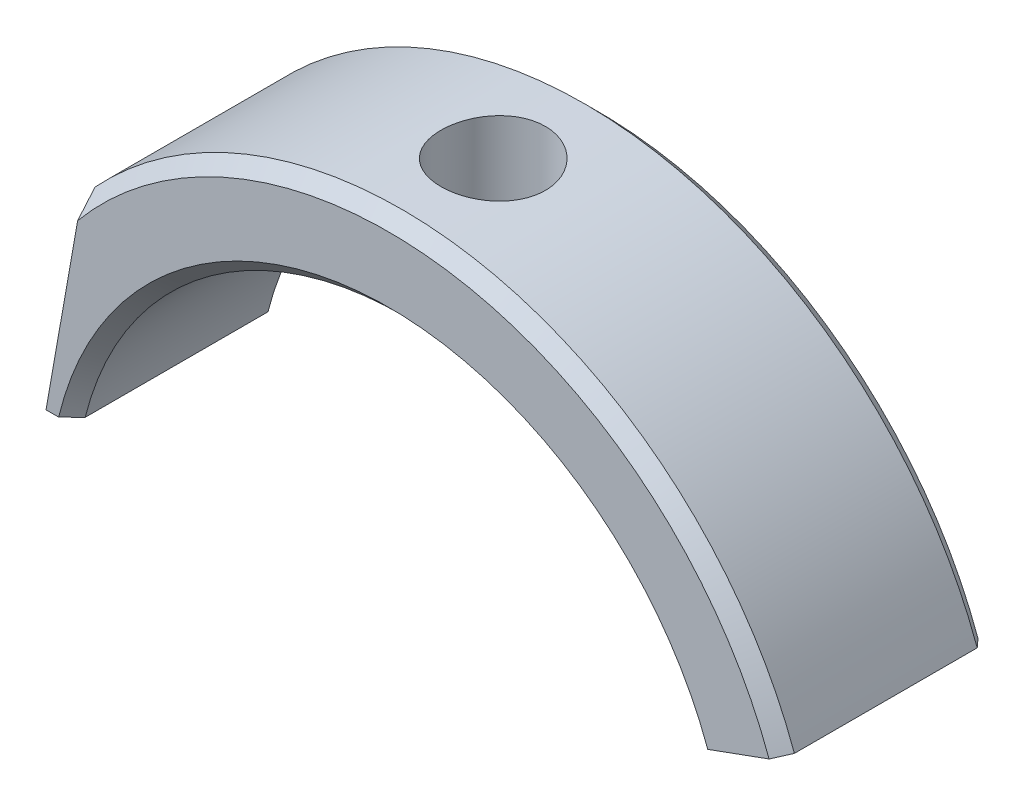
ISO-10303-21;
HEADER;
FILE_DESCRIPTION(('STEP AP214'),'2;1');
FILE_NAME('part.step','',(''),(''),'','','');
FILE_SCHEMA(('AUTOMOTIVE_DESIGN { 1 0 10303 214 1 1 1 1 }'));
ENDSEC;
DATA;
#1=APPLICATION_CONTEXT('core data for automotive mechanical design processes');
#2=APPLICATION_PROTOCOL_DEFINITION('international standard','automotive_design',2000,#1);
#3=PRODUCT_CONTEXT('',#1,'mechanical');
#4=PRODUCT('Part','Part','',(#3));
#5=PRODUCT_RELATED_PRODUCT_CATEGORY('part','',(#4));
#6=PRODUCT_DEFINITION_FORMATION('','',#4);
#7=PRODUCT_DEFINITION_CONTEXT('part definition',#1,'design');
#8=PRODUCT_DEFINITION('design','',#6,#7);
#9=PRODUCT_DEFINITION_SHAPE('','',#8);
#10=(LENGTH_UNIT() NAMED_UNIT(*) SI_UNIT(.MILLI.,.METRE.));
#11=(NAMED_UNIT(*) PLANE_ANGLE_UNIT() SI_UNIT($,.RADIAN.));
#12=(NAMED_UNIT(*) SI_UNIT($,.STERADIAN.) SOLID_ANGLE_UNIT());
#13=UNCERTAINTY_MEASURE_WITH_UNIT(LENGTH_MEASURE(1.E-05),#10,'distance_accuracy_value','');
#14=(GEOMETRIC_REPRESENTATION_CONTEXT(3) GLOBAL_UNCERTAINTY_ASSIGNED_CONTEXT((#13)) GLOBAL_UNIT_ASSIGNED_CONTEXT((#10,
#11,#12)) REPRESENTATION_CONTEXT('',''));
#15=CARTESIAN_POINT('',(0.,0.,0.));
#16=DIRECTION('',(0.,0.,1.));
#17=DIRECTION('',(1.,0.,0.));
#18=AXIS2_PLACEMENT_3D('',#15,#16,#17);
#19=CARTESIAN_POINT('',(0.,0.,4.));
#20=DIRECTION('',(0.,0.,-1.));
#21=DIRECTION('',(-1.,0.,0.));
#22=AXIS2_PLACEMENT_3D('',#19,#20,#21);
#23=CYLINDRICAL_SURFACE('',#22,12.5);
#24=DIRECTION('',(0.,0.,-1.));
#25=VECTOR('',#24,1.);
#26=CARTESIAN_POINT('',(11.7461577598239,4.27525179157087,4.));
#27=LINE('',#26,#25);
#28=CARTESIAN_POINT('',(11.7461577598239,4.27525179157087,3.5));
#29=VERTEX_POINT('',#28);
#30=CARTESIAN_POINT('',(11.7461577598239,4.27525179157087,-3.50000000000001));
#31=VERTEX_POINT('',#30);
#32=EDGE_CURVE('E141',#29,#31,#27,.T.);
#33=ORIENTED_EDGE('',*,*,#32,.F.);
#34=CARTESIAN_POINT('',(0.,0.,3.5));
#35=DIRECTION('',(0.,0.,1.));
#36=DIRECTION('',(1.,0.,0.));
#37=AXIS2_PLACEMENT_3D('',#34,#35,#36);
#38=CIRCLE('',#37,12.5);
#39=CARTESIAN_POINT('',(-12.125659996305,3.0361768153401,3.5));
#40=VERTEX_POINT('',#39);
#41=EDGE_CURVE('E196',#29,#40,#38,.T.);
#42=ORIENTED_EDGE('',*,*,#41,.T.);
#43=DIRECTION('',(0.,0.,-1.));
#44=VECTOR('',#43,1.);
#45=CARTESIAN_POINT('',(-12.125659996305,3.0361768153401,4.));
#46=LINE('',#45,#44);
#47=CARTESIAN_POINT('',(-12.125659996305,3.0361768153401,-3.5));
#48=VERTEX_POINT('',#47);
#49=EDGE_CURVE('E120',#40,#48,#46,.T.);
#50=ORIENTED_EDGE('',*,*,#49,.T.);
#51=CARTESIAN_POINT('',(0.,0.,-3.5));
#52=DIRECTION('',(0.,0.,1.));
#53=DIRECTION('',(1.,0.,0.));
#54=AXIS2_PLACEMENT_3D('',#51,#52,#53);
#55=CIRCLE('',#54,12.5);
#56=EDGE_CURVE('E193',#48,#31,#55,.F.);
#57=ORIENTED_EDGE('',*,*,#56,.T.);
#58=EDGE_LOOP('',(#33,#42,#50,#57));
#59=FACE_BOUND('',#58,.T.);
#60=CARTESIAN_POINT('',(0.,12.5,-2.));
#61=CARTESIAN_POINT('',(0.111577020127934,12.4999981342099,-1.99999547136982));
#62=CARTESIAN_POINT('',(0.223216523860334,12.4984904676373,-1.99063139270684));
#63=CARTESIAN_POINT('',(0.443368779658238,12.4926212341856,-1.95343555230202));
#64=CARTESIAN_POINT('',(0.551878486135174,12.4882569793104,-1.92558639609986));
#65=CARTESIAN_POINT('',(0.762553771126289,12.4771644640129,-1.85227911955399));
#66=CARTESIAN_POINT('',(0.864724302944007,12.4704380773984,-1.80683495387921));
#67=CARTESIAN_POINT('',(1.05997584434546,12.4553623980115,-1.69966320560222));
#68=CARTESIAN_POINT('',(1.15305798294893,12.4470133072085,-1.63793764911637));
#69=CARTESIAN_POINT('',(1.32832749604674,12.4295364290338,-1.49937439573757));
#70=CARTESIAN_POINT('',(1.41042286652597,12.4204030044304,-1.42242102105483));
#71=CARTESIAN_POINT('',(1.56059410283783,12.4024303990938,-1.25583553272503));
#72=CARTESIAN_POINT('',(1.62866911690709,12.393591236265,-1.16620264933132));
#73=CARTESIAN_POINT('',(1.74923165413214,12.377153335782,-0.976176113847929));
#74=CARTESIAN_POINT('',(1.80162899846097,12.369561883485,-0.875724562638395));
#75=CARTESIAN_POINT('',(1.88877230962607,12.3565566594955,-0.667304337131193));
#76=CARTESIAN_POINT('',(1.92351937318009,12.3511427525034,-0.559336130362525));
#77=CARTESIAN_POINT('',(1.97408758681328,12.3431614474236,-0.339919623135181));
#78=CARTESIAN_POINT('',(1.990067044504,12.3405702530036,-0.228508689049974));
#79=CARTESIAN_POINT('',(2.00313711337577,12.3384556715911,-0.00455901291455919));
#80=CARTESIAN_POINT('',(2.00022895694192,12.3389320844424,0.107979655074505));
#81=CARTESIAN_POINT('',(1.97573547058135,12.3428771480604,0.329865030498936));
#82=CARTESIAN_POINT('',(1.95432734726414,12.3463174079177,0.43923187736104));
#83=CARTESIAN_POINT('',(1.8937194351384,12.3557581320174,0.652801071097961));
#84=CARTESIAN_POINT('',(1.85451907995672,12.36175867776,0.757003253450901));
#85=CARTESIAN_POINT('',(1.75925788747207,12.375674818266,0.957819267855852));
#86=CARTESIAN_POINT('',(1.70312285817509,12.3835988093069,1.05439729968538));
#87=CARTESIAN_POINT('',(1.57563852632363,12.4004630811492,1.23683027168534));
#88=CARTESIAN_POINT('',(1.50428809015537,12.4094034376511,1.32268441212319));
#89=CARTESIAN_POINT('',(1.34742984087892,12.4274181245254,1.48225880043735));
#90=CARTESIAN_POINT('',(1.26176985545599,12.4364928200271,1.55582950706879));
#91=CARTESIAN_POINT('',(1.07924037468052,12.4536592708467,1.68757473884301));
#92=CARTESIAN_POINT('',(0.982370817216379,12.4617510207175,1.74574917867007));
#93=CARTESIAN_POINT('',(0.780035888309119,12.4760500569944,1.84506167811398));
#94=CARTESIAN_POINT('',(0.67456426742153,12.4822559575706,1.88618721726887));
#95=CARTESIAN_POINT('',(0.458089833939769,12.492072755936,1.95009935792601));
#96=CARTESIAN_POINT('',(0.347087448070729,12.4956838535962,1.97288737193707));
#97=CARTESIAN_POINT('',(0.123992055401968,12.4998774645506,1.99927647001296));
#98=CARTESIAN_POINT('',(0.0119239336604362,12.5004923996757,2.00308296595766));
#99=CARTESIAN_POINT('',(-0.211249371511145,12.4987129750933,1.99194761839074));
#100=CARTESIAN_POINT('',(-0.32235458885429,12.4963187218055,1.97700643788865));
#101=CARTESIAN_POINT('',(-0.53981879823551,12.4888100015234,1.92897070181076));
#102=CARTESIAN_POINT('',(-0.646200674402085,12.4837106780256,1.89597717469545));
#103=CARTESIAN_POINT('',(-0.851922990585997,12.4713614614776,1.81288053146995));
#104=CARTESIAN_POINT('',(-0.951263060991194,12.4641114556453,1.7627765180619));
#105=CARTESIAN_POINT('',(-1.14097865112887,12.4481852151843,1.64640600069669));
#106=CARTESIAN_POINT('',(-1.23127400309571,12.4394977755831,1.58001036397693));
#107=CARTESIAN_POINT('',(-1.39951415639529,12.4216959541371,1.43311984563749));
#108=CARTESIAN_POINT('',(-1.47745813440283,12.4125815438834,1.35262402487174));
#109=CARTESIAN_POINT('',(-1.61953866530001,12.3948490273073,1.17889961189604));
#110=CARTESIAN_POINT('',(-1.6835368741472,12.3862364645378,1.08555722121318));
#111=CARTESIAN_POINT('',(-1.7949448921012,12.3705841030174,0.889326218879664));
#112=CARTESIAN_POINT('',(-1.84235519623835,12.3635442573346,0.7864378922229));
#113=CARTESIAN_POINT('',(-1.91903158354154,12.3518754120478,0.574433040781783));
#114=CARTESIAN_POINT('',(-1.94836814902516,12.3472370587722,0.46534254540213));
#115=CARTESIAN_POINT('',(-1.9882871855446,12.3408723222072,0.243702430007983));
#116=CARTESIAN_POINT('',(-1.99887114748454,12.3391457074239,0.131153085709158));
#117=CARTESIAN_POINT('',(-2.00094546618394,12.3388093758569,-0.0928294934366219));
#118=CARTESIAN_POINT('',(-1.99265347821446,12.3401641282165,-0.204260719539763));
#119=CARTESIAN_POINT('',(-1.95768017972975,12.3457602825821,-0.424121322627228));
#120=CARTESIAN_POINT('',(-1.93099891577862,12.3500016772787,-0.532550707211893));
#121=CARTESIAN_POINT('',(-1.86008521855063,12.3608801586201,-0.743255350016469));
#122=CARTESIAN_POINT('',(-1.81587007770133,12.3675148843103,-0.845536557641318));
#123=CARTESIAN_POINT('',(-1.71116577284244,12.3824349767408,-1.04126446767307));
#124=CARTESIAN_POINT('',(-1.65067590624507,12.3907204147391,-1.13471078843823));
#125=CARTESIAN_POINT('',(-1.51435663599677,12.4081216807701,-1.31121858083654));
#126=CARTESIAN_POINT('',(-1.43836664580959,12.417245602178,-1.39415524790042));
#127=CARTESIAN_POINT('',(-1.27354334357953,12.4352300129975,-1.54617538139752));
#128=CARTESIAN_POINT('',(-1.18470706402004,12.44409044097,-1.61525563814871));
#129=CARTESIAN_POINT('',(-0.996048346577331,12.4606140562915,-1.73799746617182));
#130=CARTESIAN_POINT('',(-0.896160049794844,12.4682693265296,-1.7915588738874));
#131=CARTESIAN_POINT('',(-0.688725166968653,12.4814428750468,-1.88106129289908));
#132=CARTESIAN_POINT('',(-0.581186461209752,12.4869633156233,-1.91702014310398));
#133=CARTESIAN_POINT('',(-0.394335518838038,12.4940175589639,-1.96234573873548));
#134=CARTESIAN_POINT('',(-0.31616347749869,12.4962491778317,-1.9764439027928));
#135=CARTESIAN_POINT('',(-0.158671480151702,12.4992410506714,-1.99527257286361));
#136=CARTESIAN_POINT('',(-0.0793515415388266,12.5000013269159,-2.00000322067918));
#137=CARTESIAN_POINT('',(0.,12.5,-2.));
#138=B_SPLINE_CURVE_WITH_KNOTS('',3,(#60,#61,#62,#63,#64,#65,#66,#67,#68,#69,#70,#71,#72,#73,
#74,#75,#76,#77,#78,#79,#80,#81,#82,#83,#84,#85,#86,#87,#88,#89,#90,#91,#92,#93,#94,#95,#96,#97,
#98,#99,#100,#101,#102,#103,#104,#105,#106,#107,#108,#109,#110,#111,#112,#113,#114,#115,#116,
#117,#118,#119,#120,#121,#122,#123,#124,#125,#126,#127,#128,#129,#130,#131,#132,#133,#134,#135,
#136,#137),.UNSPECIFIED.,.T.,.F.,(4,2,2,2,2,2,2,2,2,2,2,2,2,2,2,2,2,2,2,2,2,2,2,2,2,2,2,2,2,2,2,
2,2,2,2,2,2,2,4),(0.,0.334441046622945,0.669197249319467,1.00368849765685,1.33813814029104,
1.67523334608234,2.0123490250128,2.35136809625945,2.69036609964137,3.0264835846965,
3.36257913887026,3.695490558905,4.02841257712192,4.36281487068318,4.69724208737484,
5.0354831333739,5.37372605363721,5.71221693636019,6.05068174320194,6.38547572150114,
6.72025786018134,7.05318530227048,7.38613020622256,7.72180459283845,8.0575013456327,
8.39639027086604,8.73526908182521,9.07281785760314,9.41033979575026,9.74398956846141,
10.0776384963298,10.4109591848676,10.7442942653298,11.0812763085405,11.4183363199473,
11.7575256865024,12.0963705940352,12.3342225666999,12.5720709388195),.UNSPECIFIED.);
#139=CARTESIAN_POINT('',(0.,12.5,-2.));
#140=VERTEX_POINT('',#139);
#141=EDGE_CURVE('E169',#140,#140,#138,.T.);
#142=ORIENTED_EDGE('',*,*,#141,.F.);
#143=EDGE_LOOP('',(#142));
#144=FACE_BOUND('',#143,.T.);
#145=ADVANCED_FACE('F31',(#59,#144),#23,.F.);
#146=CARTESIAN_POINT('',(0.,0.,4.));
#147=DIRECTION('',(0.,0.,-1.));
#148=DIRECTION('',(-1.,0.,0.));
#149=AXIS2_PLACEMENT_3D('',#146,#147,#148);
#150=CYLINDRICAL_SURFACE('',#149,16.);
#151=DIRECTION('',(0.,0.,-1.));
#152=VECTOR('',#151,1.);
#153=CARTESIAN_POINT('',(-11.7452130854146,10.8650802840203,4.));
#154=LINE('',#153,#152);
#155=CARTESIAN_POINT('',(-11.7452130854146,10.8650802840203,3.5));
#156=VERTEX_POINT('',#155);
#157=CARTESIAN_POINT('',(-11.7452130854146,10.8650802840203,-3.5));
#158=VERTEX_POINT('',#157);
#159=EDGE_CURVE('E119',#156,#158,#154,.T.);
#160=ORIENTED_EDGE('',*,*,#159,.F.);
#161=CARTESIAN_POINT('',(0.,0.,3.5));
#162=DIRECTION('',(0.,0.,1.));
#163=DIRECTION('',(1.,0.,0.));
#164=AXIS2_PLACEMENT_3D('',#161,#162,#163);
#165=CIRCLE('',#164,16.);
#166=CARTESIAN_POINT('',(15.0350819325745,5.47232229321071,3.49999999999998));
#167=VERTEX_POINT('',#166);
#168=EDGE_CURVE('E11',#156,#167,#165,.F.);
#169=ORIENTED_EDGE('',*,*,#168,.T.);
#170=DIRECTION('',(0.,0.,-1.));
#171=VECTOR('',#170,1.);
#172=CARTESIAN_POINT('',(15.0350819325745,5.47232229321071,4.));
#173=LINE('',#172,#171);
#174=CARTESIAN_POINT('',(15.0350819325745,5.47232229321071,-3.49999999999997));
#175=VERTEX_POINT('',#174);
#176=EDGE_CURVE('E138',#167,#175,#173,.T.);
#177=ORIENTED_EDGE('',*,*,#176,.T.);
#178=CARTESIAN_POINT('',(0.,0.,-3.5));
#179=DIRECTION('',(0.,0.,1.));
#180=DIRECTION('',(1.,0.,0.));
#181=AXIS2_PLACEMENT_3D('',#178,#179,#180);
#182=CIRCLE('',#181,16.);
#183=EDGE_CURVE('E39',#175,#158,#182,.T.);
#184=ORIENTED_EDGE('',*,*,#183,.T.);
#185=EDGE_LOOP('',(#160,#169,#177,#184));
#186=FACE_BOUND('',#185,.T.);
#187=CARTESIAN_POINT('',(0.,16.,-2.));
#188=CARTESIAN_POINT('',(-0.111872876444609,15.9999984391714,-1.99999524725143));
#189=CARTESIAN_POINT('',(-0.223815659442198,15.9988142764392,-1.99058169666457));
#190=CARTESIAN_POINT('',(-0.444586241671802,15.9942043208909,-1.95317779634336));
#191=CARTESIAN_POINT('',(-0.553410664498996,15.9907761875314,-1.92516804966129));
#192=CARTESIAN_POINT('',(-0.764716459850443,15.9820644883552,-1.85140988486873));
#193=CARTESIAN_POINT('',(-0.86720204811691,15.9767821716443,-1.80567340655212));
#194=CARTESIAN_POINT('',(-1.06302357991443,15.9649496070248,-1.69778617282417));
#195=CARTESIAN_POINT('',(-1.1563610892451,15.9583995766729,-1.63563823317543));
#196=CARTESIAN_POINT('',(-1.33177025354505,15.9447225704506,-1.49632644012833));
#197=CARTESIAN_POINT('',(-1.4137842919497,15.9375929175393,-1.41909029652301));
#198=CARTESIAN_POINT('',(-1.563722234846,15.923581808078,-1.25194974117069));
#199=CARTESIAN_POINT('',(-1.6316454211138,15.9167003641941,-1.1620446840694));
#200=CARTESIAN_POINT('',(-1.75168812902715,15.9039384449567,-0.971744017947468));
#201=CARTESIAN_POINT('',(-1.80375367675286,15.8980614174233,-0.871314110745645));
#202=CARTESIAN_POINT('',(-1.89025846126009,15.8880090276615,-0.663050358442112));
#203=CARTESIAN_POINT('',(-1.92469836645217,15.8838336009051,-0.555216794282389));
#204=CARTESIAN_POINT('',(-1.97479918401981,15.8776827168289,-0.335804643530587));
#205=CARTESIAN_POINT('',(-1.99055737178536,15.875695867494,-0.224248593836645));
#206=CARTESIAN_POINT('',(-2.00314843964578,15.8741122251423,-5.89892225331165E-05));
#207=CARTESIAN_POINT('',(-1.99998208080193,15.8745153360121,0.112574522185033));
#208=CARTESIAN_POINT('',(-1.97489378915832,15.877655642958,0.335043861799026));
#209=CARTESIAN_POINT('',(-1.95307901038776,15.8803795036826,0.444891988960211));
#210=CARTESIAN_POINT('',(-1.89148030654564,15.887833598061,0.65935601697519));
#211=CARTESIAN_POINT('',(-1.85169601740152,15.8925638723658,0.763971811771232));
#212=CARTESIAN_POINT('',(-1.75517244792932,15.9035129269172,0.965334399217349));
#213=CARTESIAN_POINT('',(-1.69838660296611,15.9097357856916,1.06205864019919));
#214=CARTESIAN_POINT('',(-1.56950517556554,15.9229656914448,1.2446453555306));
#215=CARTESIAN_POINT('',(-1.49740889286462,15.9299727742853,1.33050733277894));
#216=CARTESIAN_POINT('',(-1.33935928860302,15.9440408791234,1.48955416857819));
#217=CARTESIAN_POINT('',(-1.25331360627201,15.9511019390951,1.56264727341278));
#218=CARTESIAN_POINT('',(-1.07012573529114,15.9644370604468,1.69336710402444));
#219=CARTESIAN_POINT('',(-0.972983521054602,15.970711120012,1.7509937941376));
#220=CARTESIAN_POINT('',(-0.770289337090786,15.9817692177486,1.84914505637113));
#221=CARTESIAN_POINT('',(-0.664734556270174,15.9865527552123,1.88966388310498));
#222=CARTESIAN_POINT('',(-0.448246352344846,15.9940862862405,1.9523763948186));
#223=CARTESIAN_POINT('',(-0.337313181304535,15.996836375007,1.97457093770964));
#224=CARTESIAN_POINT('',(-0.114010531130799,15.9999807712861,1.99988593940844));
#225=CARTESIAN_POINT('',(-0.00165559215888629,16.0003906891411,2.00313279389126));
#226=CARTESIAN_POINT('',(0.221996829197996,15.9988507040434,1.99079381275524));
#227=CARTESIAN_POINT('',(0.333294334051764,15.9969008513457,1.97520837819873));
#228=CARTESIAN_POINT('',(0.551299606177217,15.9908701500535,1.92575223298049));
#229=CARTESIAN_POINT('',(0.658021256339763,15.986796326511,1.89194178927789));
#230=CARTESIAN_POINT('',(0.864279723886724,15.9769737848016,1.80705803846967));
#231=CARTESIAN_POINT('',(0.96381629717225,15.971225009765,1.75598414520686));
#232=CARTESIAN_POINT('',(1.15344361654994,15.9586545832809,1.63771748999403));
#233=CARTESIAN_POINT('',(1.24348300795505,15.9518275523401,1.57044296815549));
#234=CARTESIAN_POINT('',(1.41103759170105,15.9378811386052,1.42180040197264));
#235=CARTESIAN_POINT('',(1.48855228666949,15.9307617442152,1.34043179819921));
#236=CARTESIAN_POINT('',(1.62930556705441,15.9169848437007,1.16535406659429));
#237=CARTESIAN_POINT('',(1.69246036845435,15.9103301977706,1.07157732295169));
#238=CARTESIAN_POINT('',(1.8021223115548,15.8982832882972,0.874673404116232));
#239=CARTESIAN_POINT('',(1.84862978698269,15.8928909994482,0.771546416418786));
#240=CARTESIAN_POINT('',(1.92354126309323,15.883998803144,0.55913974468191));
#241=CARTESIAN_POINT('',(1.95199250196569,15.8804939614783,0.449876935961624));
#242=CARTESIAN_POINT('',(1.99013599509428,15.8757593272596,0.228078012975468));
#243=CARTESIAN_POINT('',(1.99982912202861,15.8745294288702,0.1155420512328));
#244=CARTESIAN_POINT('',(2.00016522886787,15.8744870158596,-0.108775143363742));
#245=CARTESIAN_POINT('',(1.99093983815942,15.8756577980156,-0.220556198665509));
#246=CARTESIAN_POINT('',(1.95397952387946,15.8802489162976,-0.440965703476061));
#247=CARTESIAN_POINT('',(1.92624459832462,15.8836692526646,-0.549594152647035));
#248=CARTESIAN_POINT('',(1.85309365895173,15.8923689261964,-0.760597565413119));
#249=CARTESIAN_POINT('',(1.80768398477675,15.8976475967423,-0.862974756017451));
#250=CARTESIAN_POINT('',(1.70048552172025,15.9094702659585,-1.05867732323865));
#251=CARTESIAN_POINT('',(1.63869652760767,15.9160142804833,-1.15200258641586));
#252=CARTESIAN_POINT('',(1.50000506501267,15.9296848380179,-1.32762498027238));
#253=CARTESIAN_POINT('',(1.42300450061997,15.9368149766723,-1.40984436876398));
#254=CARTESIAN_POINT('',(1.25628018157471,15.9508226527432,-1.56024546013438));
#255=CARTESIAN_POINT('',(1.16655343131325,15.9577001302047,-1.62842384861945));
#256=CARTESIAN_POINT('',(0.976532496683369,15.970456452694,-1.74902828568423));
#257=CARTESIAN_POINT('',(0.876199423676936,15.9763314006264,-1.8013934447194));
#258=CARTESIAN_POINT('',(0.668146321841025,15.9863811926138,-1.88845699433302));
#259=CARTESIAN_POINT('',(0.560434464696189,15.9905578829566,-1.92317458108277));
#260=CARTESIAN_POINT('',(0.37680461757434,15.995733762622,-1.96564747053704));
#261=CARTESIAN_POINT('',(0.302044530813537,15.9973258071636,-1.97851115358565));
#262=CARTESIAN_POINT('',(0.151533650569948,15.9994594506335,-1.99568899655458));
#263=CARTESIAN_POINT('',(0.0757828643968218,16.0000010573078,-2.00000321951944));
#264=CARTESIAN_POINT('',(0.,16.,-2.));
#265=B_SPLINE_CURVE_WITH_KNOTS('',3,(#187,#188,#189,#190,#191,#192,#193,#194,#195,#196,#197,
#198,#199,#200,#201,#202,#203,#204,#205,#206,#207,#208,#209,#210,#211,#212,#213,#214,#215,#216,
#217,#218,#219,#220,#221,#222,#223,#224,#225,#226,#227,#228,#229,#230,#231,#232,#233,#234,#235,
#236,#237,#238,#239,#240,#241,#242,#243,#244,#245,#246,#247,#248,#249,#250,#251,#252,#253,#254,
#255,#256,#257,#258,#259,#260,#261,#262,#263,#264),.UNSPECIFIED.,.T.,.F.,(4,2,2,2,2,2,2,2,2,2,2,
2,2,2,2,2,2,2,2,2,2,2,2,2,2,2,2,2,2,2,2,2,2,2,2,2,2,2,4),(0.,0.335341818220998,
0.671033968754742,1.00650040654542,1.34190932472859,1.67896650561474,2.01604086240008,
2.35425000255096,2.69244631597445,3.02887380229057,3.36528775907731,3.69978157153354,
4.03428216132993,4.36970741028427,4.70514800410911,5.04290782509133,5.38066842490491,
5.71854236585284,6.05640048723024,6.39200223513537,6.72759683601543,7.06208843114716,
7.39659138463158,7.73281922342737,8.0690604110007,8.40721577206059,8.74536435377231,
9.0826245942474,9.41986914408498,9.75477520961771,10.0896813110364,10.4244673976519,
10.7592576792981,11.0962819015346,11.4333855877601,11.7717712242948,12.1097879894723,
12.336950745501,12.5641118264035),.UNSPECIFIED.);
#266=CARTESIAN_POINT('',(0.,16.,-2.));
#267=VERTEX_POINT('',#266);
#268=EDGE_CURVE('E144',#267,#267,#265,.T.);
#269=ORIENTED_EDGE('',*,*,#268,.F.);
#270=EDGE_LOOP('',(#269));
#271=FACE_BOUND('',#270,.T.);
#272=ADVANCED_FACE('F154',(#186,#271),#150,.T.);
#273=CARTESIAN_POINT('',(11.7461577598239,4.27525179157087,4.));
#274=DIRECTION('',(-0.342020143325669,0.939692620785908,0.));
#275=DIRECTION('',(-0.939692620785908,-0.342020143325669,0.));
#276=AXIS2_PLACEMENT_3D('',#273,#274,#275);
#277=PLANE('',#276);
#278=DIRECTION('',(0.939692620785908,0.342020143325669,0.));
#279=VECTOR('',#278,1.);
#280=CARTESIAN_POINT('',(11.7461577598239,4.27525179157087,4.));
#281=LINE('',#280,#279);
#282=CARTESIAN_POINT('',(12.2160040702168,4.4462618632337,4.));
#283=VERTEX_POINT('',#282);
#284=CARTESIAN_POINT('',(14.5652356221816,5.30131222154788,3.99999999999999));
#285=VERTEX_POINT('',#284);
#286=EDGE_CURVE('E126',#283,#285,#281,.T.);
#287=ORIENTED_EDGE('',*,*,#286,.F.);
#288=DIRECTION('',(-0.664463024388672,-0.241844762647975,-0.70710678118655));
#289=VECTOR('',#288,1.);
#290=CARTESIAN_POINT('',(0.,0.,-9.00000000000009));
#291=LINE('',#290,#289);
#292=EDGE_CURVE('E191',#283,#29,#291,.T.);
#293=ORIENTED_EDGE('',*,*,#292,.T.);
#294=ORIENTED_EDGE('',*,*,#32,.T.);
#295=DIRECTION('',(0.664463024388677,0.241844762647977,-0.707106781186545));
#296=VECTOR('',#295,1.);
#297=CARTESIAN_POINT('',(0.,0.,8.99999999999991));
#298=LINE('',#297,#296);
#299=CARTESIAN_POINT('',(12.2160040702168,4.4462618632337,-4.));
#300=VERTEX_POINT('',#299);
#301=EDGE_CURVE('E181',#31,#300,#298,.T.);
#302=ORIENTED_EDGE('',*,*,#301,.T.);
#303=DIRECTION('',(0.939692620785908,0.342020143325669,0.));
#304=VECTOR('',#303,1.);
#305=CARTESIAN_POINT('',(11.7461577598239,4.27525179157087,-4.));
#306=LINE('',#305,#304);
#307=CARTESIAN_POINT('',(14.5652356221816,5.30131222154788,-3.99999999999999));
#308=VERTEX_POINT('',#307);
#309=EDGE_CURVE('E110',#300,#308,#306,.T.);
#310=ORIENTED_EDGE('',*,*,#309,.T.);
#311=DIRECTION('',(-0.664463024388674,-0.241844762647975,-0.707106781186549));
#312=VECTOR('',#311,1.);
#313=CARTESIAN_POINT('',(0.,0.,-19.5000000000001));
#314=LINE('',#313,#312);
#315=EDGE_CURVE('E180',#308,#175,#314,.F.);
#316=ORIENTED_EDGE('',*,*,#315,.T.);
#317=ORIENTED_EDGE('',*,*,#176,.F.);
#318=DIRECTION('',(0.664463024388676,0.241844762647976,-0.707106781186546));
#319=VECTOR('',#318,1.);
#320=CARTESIAN_POINT('',(0.,0.,19.4999999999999));
#321=LINE('',#320,#319);
#322=EDGE_CURVE('E184',#167,#285,#321,.F.);
#323=ORIENTED_EDGE('',*,*,#322,.T.);
#324=EDGE_LOOP('',(#287,#293,#294,#302,#310,#316,#317,#323));
#325=FACE_BOUND('',#324,.T.);
#326=ADVANCED_FACE('F178',(#325),#277,.F.);
#327=CARTESIAN_POINT('',(-11.7452130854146,10.8650802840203,4.));
#328=DIRECTION('',(0.984807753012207,-0.173648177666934,0.));
#329=DIRECTION('',(0.173648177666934,0.984807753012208,0.));
#330=AXIS2_PLACEMENT_3D('',#327,#328,#329);
#331=PLANE('',#330);
#332=DIRECTION('',(-0.173648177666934,-0.984807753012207,0.));
#333=VECTOR('',#332,1.);
#334=CARTESIAN_POINT('',(-11.7452130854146,10.8650802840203,4.));
#335=LINE('',#334,#333);
#336=CARTESIAN_POINT('',(-11.912405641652,9.91688417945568,4.));
#337=VERTEX_POINT('',#336);
#338=CARTESIAN_POINT('',(-13.125659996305,3.0361768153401,4.));
#339=VERTEX_POINT('',#338);
#340=EDGE_CURVE('E129',#337,#339,#335,.T.);
#341=ORIENTED_EDGE('',*,*,#340,.F.);
#342=CARTESIAN_POINT('',(-11.912405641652,9.91688417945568,4.));
#343=CARTESIAN_POINT('',(-11.8983434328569,9.99663492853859,3.95978275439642));
#344=CARTESIAN_POINT('',(-11.8843143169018,10.0761979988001,3.9191824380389));
#345=CARTESIAN_POINT('',(-11.8563220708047,10.2349499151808,3.83724949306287));
#346=CARTESIAN_POINT('',(-11.842358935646,10.3141387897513,3.79591692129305));
#347=CARTESIAN_POINT('',(-11.8144963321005,10.4721554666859,3.71254723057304));
#348=CARTESIAN_POINT('',(-11.8005968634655,10.5509832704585,3.6705101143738));
#349=CARTESIAN_POINT('',(-11.7728591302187,10.7082917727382,3.58575660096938));
#350=CARTESIAN_POINT('',(-11.7590208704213,10.7867724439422,3.54304015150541));
#351=CARTESIAN_POINT('',(-11.7452130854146,10.8650802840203,3.50000000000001));
#352=B_SPLINE_CURVE_WITH_KNOTS('',3,(#342,#343,#344,#345,#346,#347,#348,#349,#350,#351),
.UNSPECIFIED.,.F.,.F.,(4,2,2,2,4),(0.,0.271251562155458,0.542482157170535,0.813711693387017,
1.08496219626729),.UNSPECIFIED.);
#353=EDGE_CURVE('E54',#337,#156,#352,.T.);
#354=ORIENTED_EDGE('',*,*,#353,.T.);
#355=ORIENTED_EDGE('',*,*,#159,.T.);
#356=CARTESIAN_POINT('',(-11.7452130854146,10.8650802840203,-3.5));
#357=CARTESIAN_POINT('',(-11.7590208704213,10.7867724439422,-3.54304015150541));
#358=CARTESIAN_POINT('',(-11.7728591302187,10.7082917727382,-3.58575660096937));
#359=CARTESIAN_POINT('',(-11.8005968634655,10.5509832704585,-3.6705101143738));
#360=CARTESIAN_POINT('',(-11.8144963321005,10.4721554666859,-3.71254723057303));
#361=CARTESIAN_POINT('',(-11.842358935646,10.3141387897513,-3.79591692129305));
#362=CARTESIAN_POINT('',(-11.8563220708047,10.2349499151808,-3.83724949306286));
#363=CARTESIAN_POINT('',(-11.8843143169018,10.0761979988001,-3.9191824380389));
#364=CARTESIAN_POINT('',(-11.8983434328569,9.99663492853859,-3.95978275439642));
#365=CARTESIAN_POINT('',(-11.912405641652,9.91688417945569,-4.00000000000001));
#366=B_SPLINE_CURVE_WITH_KNOTS('',3,(#356,#357,#358,#359,#360,#361,#362,#363,#364,#365),
.UNSPECIFIED.,.F.,.F.,(4,2,2,2,4),(0.,0.271250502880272,0.54248003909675,0.813710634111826,
1.08496219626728),.UNSPECIFIED.);
#367=CARTESIAN_POINT('',(-11.912405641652,9.91688417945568,-4.));
#368=VERTEX_POINT('',#367);
#369=EDGE_CURVE('E46',#158,#368,#366,.T.);
#370=ORIENTED_EDGE('',*,*,#369,.T.);
#371=DIRECTION('',(-0.173648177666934,-0.984807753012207,0.));
#372=VECTOR('',#371,1.);
#373=CARTESIAN_POINT('',(-11.7452130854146,10.8650802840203,-4.));
#374=LINE('',#373,#372);
#375=CARTESIAN_POINT('',(-13.125659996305,3.0361768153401,-4.));
#376=VERTEX_POINT('',#375);
#377=EDGE_CURVE('E102',#368,#376,#374,.T.);
#378=ORIENTED_EDGE('',*,*,#377,.T.);
#379=DIRECTION('',(0.,0.,-1.));
#380=VECTOR('',#379,1.);
#381=CARTESIAN_POINT('',(-13.125659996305,3.0361768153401,4.));
#382=LINE('',#381,#380);
#383=EDGE_CURVE('E105',#339,#376,#382,.T.);
#384=ORIENTED_EDGE('',*,*,#383,.F.);
#385=EDGE_LOOP('',(#341,#354,#355,#370,#378,#384));
#386=FACE_BOUND('',#385,.T.);
#387=ADVANCED_FACE('F104',(#386),#331,.F.);
#388=CARTESIAN_POINT('',(-12.125659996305,3.0361768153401,4.));
#389=DIRECTION('',(0.,1.,0.));
#390=DIRECTION('',(-1.,0.,0.));
#391=AXIS2_PLACEMENT_3D('',#388,#389,#390);
#392=PLANE('',#391);
#393=ORIENTED_EDGE('',*,*,#49,.F.);
#394=CARTESIAN_POINT('',(-12.125659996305,3.0361768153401,3.5));
#395=CARTESIAN_POINT('',(-12.2115117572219,3.0361768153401,3.5832827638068));
#396=CARTESIAN_POINT('',(-12.2973389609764,3.0361768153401,3.66659081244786));
#397=CARTESIAN_POINT('',(-12.4689442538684,3.0361768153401,3.8332574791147));
#398=CARTESIAN_POINT('',(-12.5547223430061,3.0361768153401,3.91661609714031));
#399=CARTESIAN_POINT('',(-12.6404758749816,3.0361768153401,4.));
#400=B_SPLINE_CURVE_WITH_KNOTS('',3,(#394,#395,#396,#397,#398,#399),.UNSPECIFIED.,.F.,.F.,(4,2,
4),(0.,0.358829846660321,0.71765969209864),.UNSPECIFIED.);
#401=CARTESIAN_POINT('',(-12.6404758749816,3.0361768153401,4.));
#402=VERTEX_POINT('',#401);
#403=EDGE_CURVE('E205',#40,#402,#400,.T.);
#404=ORIENTED_EDGE('',*,*,#403,.T.);
#405=DIRECTION('',(1.,0.,0.));
#406=VECTOR('',#405,1.);
#407=CARTESIAN_POINT('',(-12.125659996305,3.0361768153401,4.));
#408=LINE('',#407,#406);
#409=EDGE_CURVE('E118',#339,#402,#408,.T.);
#410=ORIENTED_EDGE('',*,*,#409,.F.);
#411=ORIENTED_EDGE('',*,*,#383,.T.);
#412=DIRECTION('',(1.,0.,0.));
#413=VECTOR('',#412,1.);
#414=CARTESIAN_POINT('',(-12.125659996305,3.0361768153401,-4.));
#415=LINE('',#414,#413);
#416=CARTESIAN_POINT('',(-12.6404758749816,3.0361768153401,-4.));
#417=VERTEX_POINT('',#416);
#418=EDGE_CURVE('E109',#376,#417,#415,.T.);
#419=ORIENTED_EDGE('',*,*,#418,.T.);
#420=CARTESIAN_POINT('',(-12.6404758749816,3.0361768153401,-4.));
#421=CARTESIAN_POINT('',(-12.5547223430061,3.0361768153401,-3.91661609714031));
#422=CARTESIAN_POINT('',(-12.4689442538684,3.0361768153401,-3.8332574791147));
#423=CARTESIAN_POINT('',(-12.2973389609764,3.0361768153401,-3.66659081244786));
#424=CARTESIAN_POINT('',(-12.2115117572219,3.0361768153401,-3.5832827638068));
#425=CARTESIAN_POINT('',(-12.125659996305,3.0361768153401,-3.5));
#426=B_SPLINE_CURVE_WITH_KNOTS('',3,(#420,#421,#422,#423,#424,#425),.UNSPECIFIED.,.F.,.F.,(4,2,
4),(0.,0.358829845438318,0.717659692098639),.UNSPECIFIED.);
#427=EDGE_CURVE('E198',#417,#48,#426,.T.);
#428=ORIENTED_EDGE('',*,*,#427,.T.);
#429=EDGE_LOOP('',(#393,#404,#410,#411,#419,#428));
#430=FACE_BOUND('',#429,.T.);
#431=ADVANCED_FACE('F115',(#430),#392,.F.);
#432=CARTESIAN_POINT('',(0.,0.,4.));
#433=DIRECTION('',(0.,0.,1.));
#434=DIRECTION('',(1.,0.,0.));
#435=AXIS2_PLACEMENT_3D('',#432,#433,#434);
#436=PLANE('',#435);
#437=ORIENTED_EDGE('',*,*,#409,.T.);
#438=CARTESIAN_POINT('',(0.,0.,4.));
#439=DIRECTION('',(0.,0.,1.));
#440=DIRECTION('',(1.,0.,0.));
#441=AXIS2_PLACEMENT_3D('',#438,#439,#440);
#442=CIRCLE('',#441,13.);
#443=EDGE_CURVE('E185',#402,#283,#442,.F.);
#444=ORIENTED_EDGE('',*,*,#443,.T.);
#445=ORIENTED_EDGE('',*,*,#286,.T.);
#446=CARTESIAN_POINT('',(0.,0.,4.));
#447=DIRECTION('',(0.,0.,1.));
#448=DIRECTION('',(1.,0.,0.));
#449=AXIS2_PLACEMENT_3D('',#446,#447,#448);
#450=CIRCLE('',#449,15.5);
#451=EDGE_CURVE('E152',#285,#337,#450,.T.);
#452=ORIENTED_EDGE('',*,*,#451,.T.);
#453=ORIENTED_EDGE('',*,*,#340,.T.);
#454=EDGE_LOOP('',(#437,#444,#445,#452,#453));
#455=FACE_BOUND('',#454,.T.);
#456=ADVANCED_FACE('F216',(#455),#436,.T.);
#457=CARTESIAN_POINT('',(0.,0.,-4.));
#458=DIRECTION('',(0.,0.,1.));
#459=DIRECTION('',(1.,0.,0.));
#460=AXIS2_PLACEMENT_3D('',#457,#458,#459);
#461=PLANE('',#460);
#462=ORIENTED_EDGE('',*,*,#309,.F.);
#463=CARTESIAN_POINT('',(0.,0.,-4.));
#464=DIRECTION('',(0.,0.,1.));
#465=DIRECTION('',(1.,0.,0.));
#466=AXIS2_PLACEMENT_3D('',#463,#464,#465);
#467=CIRCLE('',#466,13.);
#468=EDGE_CURVE('E125',#300,#417,#467,.T.);
#469=ORIENTED_EDGE('',*,*,#468,.T.);
#470=ORIENTED_EDGE('',*,*,#418,.F.);
#471=ORIENTED_EDGE('',*,*,#377,.F.);
#472=CARTESIAN_POINT('',(0.,0.,-4.));
#473=DIRECTION('',(0.,0.,1.));
#474=DIRECTION('',(1.,0.,0.));
#475=AXIS2_PLACEMENT_3D('',#472,#473,#474);
#476=CIRCLE('',#475,15.5);
#477=EDGE_CURVE('E183',#368,#308,#476,.F.);
#478=ORIENTED_EDGE('',*,*,#477,.T.);
#479=EDGE_LOOP('',(#462,#469,#470,#471,#478));
#480=FACE_BOUND('',#479,.T.);
#481=ADVANCED_FACE('F123',(#480),#461,.F.);
#482=CARTESIAN_POINT('',(0.,16.,0.));
#483=DIRECTION('',(0.,-1.,0.));
#484=DIRECTION('',(0.,0.,-1.));
#485=AXIS2_PLACEMENT_3D('',#482,#483,#484);
#486=CYLINDRICAL_SURFACE('',#485,2.);
#487=ORIENTED_EDGE('',*,*,#268,.T.);
#488=EDGE_LOOP('',(#487));
#489=FACE_BOUND('',#488,.T.);
#490=ORIENTED_EDGE('',*,*,#141,.T.);
#491=EDGE_LOOP('',(#490));
#492=FACE_BOUND('',#491,.T.);
#493=ADVANCED_FACE('F157',(#489,#492),#486,.F.);
#494=CARTESIAN_POINT('',(0.,0.,4.));
#495=DIRECTION('',(0.,0.,1.));
#496=DIRECTION('',(1.,0.,0.));
#497=AXIS2_PLACEMENT_3D('',#494,#495,#496);
#498=CONICAL_SURFACE('',#497,13.,0.785398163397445);
#499=ORIENTED_EDGE('',*,*,#403,.F.);
#500=ORIENTED_EDGE('',*,*,#41,.F.);
#501=ORIENTED_EDGE('',*,*,#292,.F.);
#502=ORIENTED_EDGE('',*,*,#443,.F.);
#503=EDGE_LOOP('',(#499,#500,#501,#502));
#504=FACE_BOUND('',#503,.T.);
#505=ADVANCED_FACE('F162',(#504),#498,.F.);
#506=CARTESIAN_POINT('',(0.,0.,-3.5));
#507=DIRECTION('',(0.,0.,-1.));
#508=DIRECTION('',(-1.,0.,0.));
#509=AXIS2_PLACEMENT_3D('',#506,#507,#508);
#510=CONICAL_SURFACE('',#509,12.5,0.785398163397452);
#511=ORIENTED_EDGE('',*,*,#427,.F.);
#512=ORIENTED_EDGE('',*,*,#468,.F.);
#513=ORIENTED_EDGE('',*,*,#301,.F.);
#514=ORIENTED_EDGE('',*,*,#56,.F.);
#515=EDGE_LOOP('',(#511,#512,#513,#514));
#516=FACE_BOUND('',#515,.T.);
#517=ADVANCED_FACE('F211',(#516),#510,.F.);
#518=CARTESIAN_POINT('',(0.,0.,4.));
#519=DIRECTION('',(0.,0.,-1.));
#520=DIRECTION('',(-1.,0.,0.));
#521=AXIS2_PLACEMENT_3D('',#518,#519,#520);
#522=CONICAL_SURFACE('',#521,15.5,0.78539816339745);
#523=ORIENTED_EDGE('',*,*,#322,.F.);
#524=ORIENTED_EDGE('',*,*,#168,.F.);
#525=ORIENTED_EDGE('',*,*,#353,.F.);
#526=ORIENTED_EDGE('',*,*,#451,.F.);
#527=EDGE_LOOP('',(#523,#524,#525,#526));
#528=FACE_BOUND('',#527,.T.);
#529=ADVANCED_FACE('F233',(#528),#522,.T.);
#530=CARTESIAN_POINT('',(0.,0.,-3.5));
#531=DIRECTION('',(0.,0.,1.));
#532=DIRECTION('',(1.,0.,0.));
#533=AXIS2_PLACEMENT_3D('',#530,#531,#532);
#534=CONICAL_SURFACE('',#533,16.,0.785398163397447);
#535=ORIENTED_EDGE('',*,*,#315,.F.);
#536=ORIENTED_EDGE('',*,*,#477,.F.);
#537=ORIENTED_EDGE('',*,*,#369,.F.);
#538=ORIENTED_EDGE('',*,*,#183,.F.);
#539=EDGE_LOOP('',(#535,#536,#537,#538));
#540=FACE_BOUND('',#539,.T.);
#541=ADVANCED_FACE('F182',(#540),#534,.T.);
#542=CLOSED_SHELL('',(#145,#272,#326,#387,#431,#456,#481,#493,#505,#517,#529,#541));
#543=MANIFOLD_SOLID_BREP('B2',#542);
#544=ADVANCED_BREP_SHAPE_REPRESENTATION('',(#18,#543),#14);
#545=SHAPE_DEFINITION_REPRESENTATION(#9,#544);
ENDSEC;
END-ISO-10303-21;
